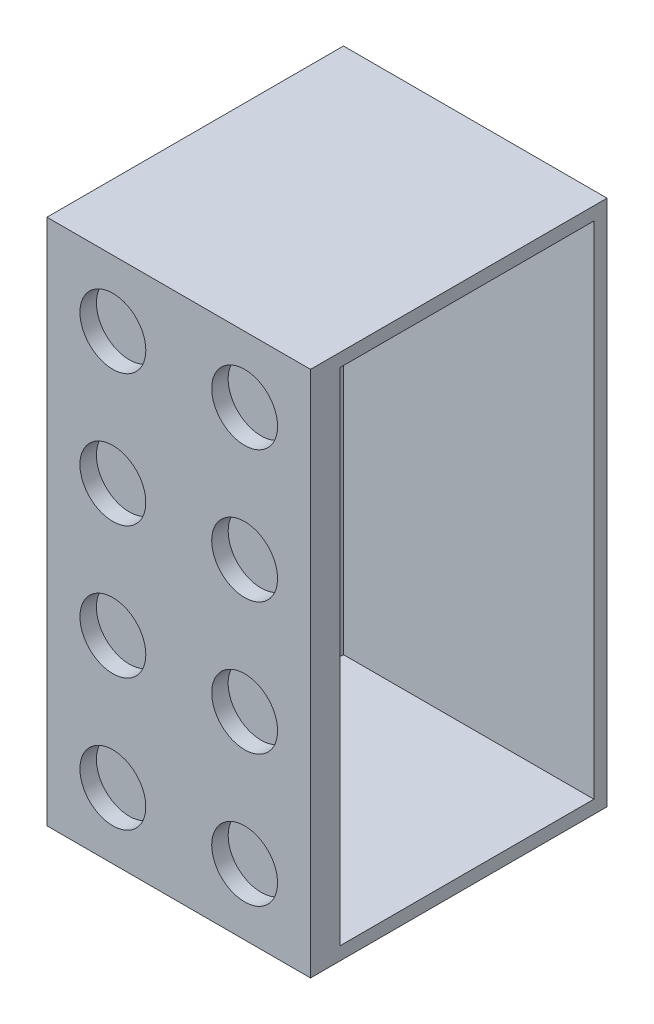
ISO-10303-21;
HEADER;
FILE_DESCRIPTION(('STEP AP214'),'2;1');
FILE_NAME('part.step','',(''),(''),'','','');
FILE_SCHEMA(('AUTOMOTIVE_DESIGN { 1 0 10303 214 1 1 1 1 }'));
ENDSEC;
DATA;
#1=APPLICATION_CONTEXT('core data for automotive mechanical design processes');
#2=APPLICATION_PROTOCOL_DEFINITION('international standard','automotive_design',2000,#1);
#3=PRODUCT_CONTEXT('',#1,'mechanical');
#4=PRODUCT('Part','Part','',(#3));
#5=PRODUCT_RELATED_PRODUCT_CATEGORY('part','',(#4));
#6=PRODUCT_DEFINITION_FORMATION('','',#4);
#7=PRODUCT_DEFINITION_CONTEXT('part definition',#1,'design');
#8=PRODUCT_DEFINITION('design','',#6,#7);
#9=PRODUCT_DEFINITION_SHAPE('','',#8);
#10=(LENGTH_UNIT() NAMED_UNIT(*) SI_UNIT(.MILLI.,.METRE.));
#11=(NAMED_UNIT(*) PLANE_ANGLE_UNIT() SI_UNIT($,.RADIAN.));
#12=(NAMED_UNIT(*) SI_UNIT($,.STERADIAN.) SOLID_ANGLE_UNIT());
#13=UNCERTAINTY_MEASURE_WITH_UNIT(LENGTH_MEASURE(1.E-05),#10,'distance_accuracy_value','');
#14=(GEOMETRIC_REPRESENTATION_CONTEXT(3) GLOBAL_UNCERTAINTY_ASSIGNED_CONTEXT((#13)) GLOBAL_UNIT_ASSIGNED_CONTEXT((#10,
#11,#12)) REPRESENTATION_CONTEXT('',''));
#15=CARTESIAN_POINT('',(0.,0.,0.));
#16=DIRECTION('',(0.,0.,1.));
#17=DIRECTION('',(1.,0.,0.));
#18=AXIS2_PLACEMENT_3D('',#15,#16,#17);
#19=CARTESIAN_POINT('',(0.,0.,57.15));
#20=DIRECTION('',(0.,0.,-1.));
#21=DIRECTION('',(-1.,0.,0.));
#22=AXIS2_PLACEMENT_3D('',#19,#20,#21);
#23=PLANE('',#22);
#24=CARTESIAN_POINT('',(12.7,63.5,57.15));
#25=DIRECTION('',(0.,0.,-1.));
#26=DIRECTION('',(-1.,0.,0.));
#27=AXIS2_PLACEMENT_3D('',#24,#25,#26);
#28=CIRCLE('',#27,6.35);
#29=CARTESIAN_POINT('',(6.35,63.5,57.15));
#30=VERTEX_POINT('',#29);
#31=EDGE_CURVE('E211',#30,#30,#28,.T.);
#32=ORIENTED_EDGE('',*,*,#31,.T.);
#33=EDGE_LOOP('',(#32));
#34=FACE_BOUND('',#33,.T.);
#35=CARTESIAN_POINT('',(12.7,38.1,57.15));
#36=DIRECTION('',(0.,0.,1.));
#37=DIRECTION('',(1.,0.,0.));
#38=AXIS2_PLACEMENT_3D('',#35,#36,#37);
#39=CIRCLE('',#38,6.35);
#40=CARTESIAN_POINT('',(19.05,38.1,57.15));
#41=VERTEX_POINT('',#40);
#42=EDGE_CURVE('E195',#41,#41,#39,.T.);
#43=ORIENTED_EDGE('',*,*,#42,.F.);
#44=EDGE_LOOP('',(#43));
#45=FACE_BOUND('',#44,.T.);
#46=CARTESIAN_POINT('',(38.1,63.5,57.15));
#47=DIRECTION('',(0.,0.,-1.));
#48=DIRECTION('',(-1.,0.,0.));
#49=AXIS2_PLACEMENT_3D('',#46,#47,#48);
#50=CIRCLE('',#49,6.35);
#51=CARTESIAN_POINT('',(31.75,63.5,57.15));
#52=VERTEX_POINT('',#51);
#53=EDGE_CURVE('E203',#52,#52,#50,.T.);
#54=ORIENTED_EDGE('',*,*,#53,.T.);
#55=EDGE_LOOP('',(#54));
#56=FACE_BOUND('',#55,.T.);
#57=CARTESIAN_POINT('',(38.1,38.1,57.15));
#58=DIRECTION('',(0.,0.,1.));
#59=DIRECTION('',(1.,0.,0.));
#60=AXIS2_PLACEMENT_3D('',#57,#58,#59);
#61=CIRCLE('',#60,6.35);
#62=CARTESIAN_POINT('',(44.45,38.1,57.15));
#63=VERTEX_POINT('',#62);
#64=EDGE_CURVE('E187',#63,#63,#61,.T.);
#65=ORIENTED_EDGE('',*,*,#64,.F.);
#66=EDGE_LOOP('',(#65));
#67=FACE_BOUND('',#66,.T.);
#68=CARTESIAN_POINT('',(12.7,12.7,57.15));
#69=DIRECTION('',(0.,0.,-1.));
#70=DIRECTION('',(-1.,0.,0.));
#71=AXIS2_PLACEMENT_3D('',#68,#69,#70);
#72=CIRCLE('',#71,6.35);
#73=CARTESIAN_POINT('',(6.35,12.7,57.15));
#74=VERTEX_POINT('',#73);
#75=EDGE_CURVE('E179',#74,#74,#72,.T.);
#76=ORIENTED_EDGE('',*,*,#75,.T.);
#77=EDGE_LOOP('',(#76));
#78=FACE_BOUND('',#77,.T.);
#79=DIRECTION('',(0.,-1.,0.));
#80=VECTOR('',#79,1.);
#81=CARTESIAN_POINT('',(0.,0.,57.15));
#82=LINE('',#81,#80);
#83=CARTESIAN_POINT('',(0.,101.6,57.15));
#84=VERTEX_POINT('',#83);
#85=CARTESIAN_POINT('',(0.,0.,57.15));
#86=VERTEX_POINT('',#85);
#87=EDGE_CURVE('E235',#84,#86,#82,.T.);
#88=ORIENTED_EDGE('',*,*,#87,.T.);
#89=DIRECTION('',(1.,0.,0.));
#90=VECTOR('',#89,1.);
#91=CARTESIAN_POINT('',(0.,0.,57.15));
#92=LINE('',#91,#90);
#93=CARTESIAN_POINT('',(50.8,0.,57.15));
#94=VERTEX_POINT('',#93);
#95=EDGE_CURVE('E98',#86,#94,#92,.T.);
#96=ORIENTED_EDGE('',*,*,#95,.T.);
#97=DIRECTION('',(0.,1.,0.));
#98=VECTOR('',#97,1.);
#99=CARTESIAN_POINT('',(50.8,0.,57.15));
#100=LINE('',#99,#98);
#101=CARTESIAN_POINT('',(50.8,101.6,57.15));
#102=VERTEX_POINT('',#101);
#103=EDGE_CURVE('E240',#94,#102,#100,.T.);
#104=ORIENTED_EDGE('',*,*,#103,.T.);
#105=DIRECTION('',(-1.,0.,0.));
#106=VECTOR('',#105,1.);
#107=CARTESIAN_POINT('',(0.,101.6,57.15));
#108=LINE('',#107,#106);
#109=EDGE_CURVE('E70',#102,#84,#108,.T.);
#110=ORIENTED_EDGE('',*,*,#109,.T.);
#111=EDGE_LOOP('',(#88,#96,#104,#110));
#112=FACE_BOUND('',#111,.T.);
#113=CARTESIAN_POINT('',(38.1,12.7,57.15));
#114=DIRECTION('',(0.,0.,-1.));
#115=DIRECTION('',(-1.,0.,0.));
#116=AXIS2_PLACEMENT_3D('',#113,#114,#115);
#117=CIRCLE('',#116,6.35);
#118=CARTESIAN_POINT('',(31.75,12.7,57.15));
#119=VERTEX_POINT('',#118);
#120=EDGE_CURVE('E171',#119,#119,#117,.T.);
#121=ORIENTED_EDGE('',*,*,#120,.T.);
#122=EDGE_LOOP('',(#121));
#123=FACE_BOUND('',#122,.T.);
#124=CARTESIAN_POINT('',(12.7,88.9,57.15));
#125=DIRECTION('',(0.,0.,1.));
#126=DIRECTION('',(1.,0.,0.));
#127=AXIS2_PLACEMENT_3D('',#124,#125,#126);
#128=CIRCLE('',#127,6.35);
#129=CARTESIAN_POINT('',(19.05,88.9,57.15));
#130=VERTEX_POINT('',#129);
#131=EDGE_CURVE('E227',#130,#130,#128,.T.);
#132=ORIENTED_EDGE('',*,*,#131,.F.);
#133=EDGE_LOOP('',(#132));
#134=FACE_BOUND('',#133,.T.);
#135=CARTESIAN_POINT('',(38.1,88.9,57.15));
#136=DIRECTION('',(0.,0.,1.));
#137=DIRECTION('',(1.,0.,0.));
#138=AXIS2_PLACEMENT_3D('',#135,#136,#137);
#139=CIRCLE('',#138,6.35);
#140=CARTESIAN_POINT('',(44.45,88.9,57.15));
#141=VERTEX_POINT('',#140);
#142=EDGE_CURVE('E219',#141,#141,#139,.T.);
#143=ORIENTED_EDGE('',*,*,#142,.F.);
#144=EDGE_LOOP('',(#143));
#145=FACE_BOUND('',#144,.T.);
#146=ADVANCED_FACE('F45',(#34,#45,#56,#67,#78,#112,#123,#134,#145),#23,.F.);
#147=CARTESIAN_POINT('',(0.,0.,57.15));
#148=DIRECTION('',(1.,0.,0.));
#149=DIRECTION('',(0.,0.,-1.));
#150=AXIS2_PLACEMENT_3D('',#147,#148,#149);
#151=PLANE('',#150);
#152=DIRECTION('',(0.,-1.,0.));
#153=VECTOR('',#152,1.);
#154=CARTESIAN_POINT('',(0.,0.,0.));
#155=LINE('',#154,#153);
#156=CARTESIAN_POINT('',(0.,101.6,0.));
#157=VERTEX_POINT('',#156);
#158=CARTESIAN_POINT('',(0.,0.,0.));
#159=VERTEX_POINT('',#158);
#160=EDGE_CURVE('E231',#157,#159,#155,.T.);
#161=ORIENTED_EDGE('',*,*,#160,.T.);
#162=DIRECTION('',(0.,0.,-1.));
#163=VECTOR('',#162,1.);
#164=CARTESIAN_POINT('',(0.,0.,57.15));
#165=LINE('',#164,#163);
#166=EDGE_CURVE('E11',#86,#159,#165,.T.);
#167=ORIENTED_EDGE('',*,*,#166,.F.);
#168=ORIENTED_EDGE('',*,*,#87,.F.);
#169=DIRECTION('',(0.,0.,-1.));
#170=VECTOR('',#169,1.);
#171=CARTESIAN_POINT('',(0.,101.6,57.15));
#172=LINE('',#171,#170);
#173=EDGE_CURVE('E245',#84,#157,#172,.T.);
#174=ORIENTED_EDGE('',*,*,#173,.T.);
#175=EDGE_LOOP('',(#161,#167,#168,#174));
#176=FACE_BOUND('',#175,.T.);
#177=ADVANCED_FACE('F47',(#176),#151,.F.);
#178=CARTESIAN_POINT('',(0.,0.,57.15));
#179=DIRECTION('',(0.,1.,0.));
#180=DIRECTION('',(0.,0.,1.));
#181=AXIS2_PLACEMENT_3D('',#178,#179,#180);
#182=PLANE('',#181);
#183=DIRECTION('',(1.,0.,0.));
#184=VECTOR('',#183,1.);
#185=CARTESIAN_POINT('',(0.,0.,0.));
#186=LINE('',#185,#184);
#187=CARTESIAN_POINT('',(50.8,0.,0.));
#188=VERTEX_POINT('',#187);
#189=EDGE_CURVE('E249',#159,#188,#186,.T.);
#190=ORIENTED_EDGE('',*,*,#189,.T.);
#191=DIRECTION('',(0.,0.,-1.));
#192=VECTOR('',#191,1.);
#193=CARTESIAN_POINT('',(50.8,0.,57.15));
#194=LINE('',#193,#192);
#195=EDGE_CURVE('E54',#94,#188,#194,.T.);
#196=ORIENTED_EDGE('',*,*,#195,.F.);
#197=ORIENTED_EDGE('',*,*,#95,.F.);
#198=ORIENTED_EDGE('',*,*,#166,.T.);
#199=EDGE_LOOP('',(#190,#196,#197,#198));
#200=FACE_BOUND('',#199,.T.);
#201=ADVANCED_FACE('F284',(#200),#182,.F.);
#202=CARTESIAN_POINT('',(50.8,0.,57.15));
#203=DIRECTION('',(-1.,0.,0.));
#204=DIRECTION('',(0.,0.,1.));
#205=AXIS2_PLACEMENT_3D('',#202,#203,#204);
#206=PLANE('',#205);
#207=DIRECTION('',(0.,-1.,0.));
#208=VECTOR('',#207,1.);
#209=CARTESIAN_POINT('',(50.8,99.06,51.435));
#210=LINE('',#209,#208);
#211=CARTESIAN_POINT('',(50.8,99.06,51.435));
#212=VERTEX_POINT('',#211);
#213=CARTESIAN_POINT('',(50.8,2.54,51.435));
#214=VERTEX_POINT('',#213);
#215=EDGE_CURVE('E156',#212,#214,#210,.T.);
#216=ORIENTED_EDGE('',*,*,#215,.F.);
#217=DIRECTION('',(0.,0.,1.));
#218=VECTOR('',#217,1.);
#219=CARTESIAN_POINT('',(50.8,99.06,2.54));
#220=LINE('',#219,#218);
#221=CARTESIAN_POINT('',(50.8,99.06,2.54));
#222=VERTEX_POINT('',#221);
#223=EDGE_CURVE('E61',#222,#212,#220,.T.);
#224=ORIENTED_EDGE('',*,*,#223,.F.);
#225=DIRECTION('',(0.,1.,0.));
#226=VECTOR('',#225,1.);
#227=CARTESIAN_POINT('',(50.8,2.54,2.54));
#228=LINE('',#227,#226);
#229=CARTESIAN_POINT('',(50.8,2.54,2.54));
#230=VERTEX_POINT('',#229);
#231=EDGE_CURVE('E143',#230,#222,#228,.T.);
#232=ORIENTED_EDGE('',*,*,#231,.F.);
#233=DIRECTION('',(0.,0.,-1.));
#234=VECTOR('',#233,1.);
#235=CARTESIAN_POINT('',(50.8,2.54,51.435));
#236=LINE('',#235,#234);
#237=EDGE_CURVE('E147',#214,#230,#236,.T.);
#238=ORIENTED_EDGE('',*,*,#237,.F.);
#239=EDGE_LOOP('',(#216,#224,#232,#238));
#240=FACE_BOUND('',#239,.T.);
#241=DIRECTION('',(0.,1.,0.));
#242=VECTOR('',#241,1.);
#243=CARTESIAN_POINT('',(50.8,0.,0.));
#244=LINE('',#243,#242);
#245=CARTESIAN_POINT('',(50.8,101.6,0.));
#246=VERTEX_POINT('',#245);
#247=EDGE_CURVE('E252',#188,#246,#244,.T.);
#248=ORIENTED_EDGE('',*,*,#247,.T.);
#249=DIRECTION('',(0.,0.,-1.));
#250=VECTOR('',#249,1.);
#251=CARTESIAN_POINT('',(50.8,101.6,57.15));
#252=LINE('',#251,#250);
#253=EDGE_CURVE('E259',#102,#246,#252,.T.);
#254=ORIENTED_EDGE('',*,*,#253,.F.);
#255=ORIENTED_EDGE('',*,*,#103,.F.);
#256=ORIENTED_EDGE('',*,*,#195,.T.);
#257=EDGE_LOOP('',(#248,#254,#255,#256));
#258=FACE_BOUND('',#257,.T.);
#259=ADVANCED_FACE('F266',(#240,#258),#206,.F.);
#260=CARTESIAN_POINT('',(0.,101.6,57.15));
#261=DIRECTION('',(0.,-1.,0.));
#262=DIRECTION('',(0.,0.,-1.));
#263=AXIS2_PLACEMENT_3D('',#260,#261,#262);
#264=PLANE('',#263);
#265=DIRECTION('',(-1.,0.,0.));
#266=VECTOR('',#265,1.);
#267=CARTESIAN_POINT('',(0.,101.6,0.));
#268=LINE('',#267,#266);
#269=EDGE_CURVE('E91',#246,#157,#268,.T.);
#270=ORIENTED_EDGE('',*,*,#269,.T.);
#271=ORIENTED_EDGE('',*,*,#173,.F.);
#272=ORIENTED_EDGE('',*,*,#109,.F.);
#273=ORIENTED_EDGE('',*,*,#253,.T.);
#274=EDGE_LOOP('',(#270,#271,#272,#273));
#275=FACE_BOUND('',#274,.T.);
#276=ADVANCED_FACE('F274',(#275),#264,.F.);
#277=CARTESIAN_POINT('',(0.,0.,0.));
#278=DIRECTION('',(0.,0.,-1.));
#279=DIRECTION('',(-1.,0.,0.));
#280=AXIS2_PLACEMENT_3D('',#277,#278,#279);
#281=PLANE('',#280);
#282=ORIENTED_EDGE('',*,*,#160,.F.);
#283=ORIENTED_EDGE('',*,*,#269,.F.);
#284=ORIENTED_EDGE('',*,*,#247,.F.);
#285=ORIENTED_EDGE('',*,*,#189,.F.);
#286=EDGE_LOOP('',(#282,#283,#284,#285));
#287=FACE_BOUND('',#286,.T.);
#288=ADVANCED_FACE('F270',(#287),#281,.T.);
#289=CARTESIAN_POINT('',(12.7,12.7,53.975));
#290=DIRECTION('',(0.,0.,1.));
#291=DIRECTION('',(1.,0.,0.));
#292=AXIS2_PLACEMENT_3D('',#289,#290,#291);
#293=CYLINDRICAL_SURFACE('',#292,6.35);
#294=CARTESIAN_POINT('',(12.7,12.7,53.975));
#295=DIRECTION('',(0.,0.,-1.));
#296=DIRECTION('',(-1.,0.,0.));
#297=AXIS2_PLACEMENT_3D('',#294,#295,#296);
#298=CIRCLE('',#297,6.35);
#299=CARTESIAN_POINT('',(6.35,12.7,53.975));
#300=VERTEX_POINT('',#299);
#301=EDGE_CURVE('E175',#300,#300,#298,.T.);
#302=ORIENTED_EDGE('',*,*,#301,.T.);
#303=EDGE_LOOP('',(#302));
#304=FACE_BOUND('',#303,.T.);
#305=ORIENTED_EDGE('',*,*,#75,.F.);
#306=EDGE_LOOP('',(#305));
#307=FACE_BOUND('',#306,.T.);
#308=ADVANCED_FACE('F281',(#304,#307),#293,.F.);
#309=CARTESIAN_POINT('',(12.7,12.7,53.975));
#310=DIRECTION('',(0.,0.,-1.));
#311=DIRECTION('',(-1.,0.,0.));
#312=AXIS2_PLACEMENT_3D('',#309,#310,#311);
#313=PLANE('',#312);
#314=ORIENTED_EDGE('',*,*,#301,.F.);
#315=EDGE_LOOP('',(#314));
#316=FACE_BOUND('',#315,.T.);
#317=ADVANCED_FACE('F345',(#316),#313,.F.);
#318=CARTESIAN_POINT('',(38.1,38.1,53.975));
#319=DIRECTION('',(0.,0.,1.));
#320=DIRECTION('',(1.,0.,0.));
#321=AXIS2_PLACEMENT_3D('',#318,#319,#320);
#322=CYLINDRICAL_SURFACE('',#321,6.35);
#323=CARTESIAN_POINT('',(38.1,38.1,53.975));
#324=DIRECTION('',(0.,0.,1.));
#325=DIRECTION('',(1.,0.,0.));
#326=AXIS2_PLACEMENT_3D('',#323,#324,#325);
#327=CIRCLE('',#326,6.35);
#328=CARTESIAN_POINT('',(44.45,38.1,53.975));
#329=VERTEX_POINT('',#328);
#330=EDGE_CURVE('E183',#329,#329,#327,.T.);
#331=ORIENTED_EDGE('',*,*,#330,.F.);
#332=EDGE_LOOP('',(#331));
#333=FACE_BOUND('',#332,.T.);
#334=ORIENTED_EDGE('',*,*,#64,.T.);
#335=EDGE_LOOP('',(#334));
#336=FACE_BOUND('',#335,.T.);
#337=ADVANCED_FACE('F341',(#333,#336),#322,.F.);
#338=CARTESIAN_POINT('',(38.1,38.1,53.975));
#339=DIRECTION('',(0.,0.,1.));
#340=DIRECTION('',(1.,0.,0.));
#341=AXIS2_PLACEMENT_3D('',#338,#339,#340);
#342=PLANE('',#341);
#343=ORIENTED_EDGE('',*,*,#330,.T.);
#344=EDGE_LOOP('',(#343));
#345=FACE_BOUND('',#344,.T.);
#346=ADVANCED_FACE('F337',(#345),#342,.T.);
#347=CARTESIAN_POINT('',(38.1,12.7,53.975));
#348=DIRECTION('',(0.,0.,1.));
#349=DIRECTION('',(1.,0.,0.));
#350=AXIS2_PLACEMENT_3D('',#347,#348,#349);
#351=CYLINDRICAL_SURFACE('',#350,6.35);
#352=CARTESIAN_POINT('',(38.1,12.7,53.975));
#353=DIRECTION('',(0.,0.,-1.));
#354=DIRECTION('',(-1.,0.,0.));
#355=AXIS2_PLACEMENT_3D('',#352,#353,#354);
#356=CIRCLE('',#355,6.35);
#357=CARTESIAN_POINT('',(31.75,12.7,53.975));
#358=VERTEX_POINT('',#357);
#359=EDGE_CURVE('E165',#358,#358,#356,.T.);
#360=ORIENTED_EDGE('',*,*,#359,.T.);
#361=EDGE_LOOP('',(#360));
#362=FACE_BOUND('',#361,.T.);
#363=ORIENTED_EDGE('',*,*,#120,.F.);
#364=EDGE_LOOP('',(#363));
#365=FACE_BOUND('',#364,.T.);
#366=ADVANCED_FACE('F340',(#362,#365),#351,.F.);
#367=CARTESIAN_POINT('',(38.1,12.7,53.975));
#368=DIRECTION('',(0.,0.,-1.));
#369=DIRECTION('',(-1.,0.,0.));
#370=AXIS2_PLACEMENT_3D('',#367,#368,#369);
#371=PLANE('',#370);
#372=ORIENTED_EDGE('',*,*,#359,.F.);
#373=EDGE_LOOP('',(#372));
#374=FACE_BOUND('',#373,.T.);
#375=ADVANCED_FACE('F304',(#374),#371,.F.);
#376=CARTESIAN_POINT('',(12.7,88.9,53.975));
#377=DIRECTION('',(0.,0.,1.));
#378=DIRECTION('',(1.,0.,0.));
#379=AXIS2_PLACEMENT_3D('',#376,#377,#378);
#380=CYLINDRICAL_SURFACE('',#379,6.35);
#381=CARTESIAN_POINT('',(12.7,88.9,53.975));
#382=DIRECTION('',(0.,0.,1.));
#383=DIRECTION('',(1.,0.,0.));
#384=AXIS2_PLACEMENT_3D('',#381,#382,#383);
#385=CIRCLE('',#384,6.35);
#386=CARTESIAN_POINT('',(19.05,88.9,53.975));
#387=VERTEX_POINT('',#386);
#388=EDGE_CURVE('E223',#387,#387,#385,.T.);
#389=ORIENTED_EDGE('',*,*,#388,.F.);
#390=EDGE_LOOP('',(#389));
#391=FACE_BOUND('',#390,.T.);
#392=ORIENTED_EDGE('',*,*,#131,.T.);
#393=EDGE_LOOP('',(#392));
#394=FACE_BOUND('',#393,.T.);
#395=ADVANCED_FACE('F300',(#391,#394),#380,.F.);
#396=CARTESIAN_POINT('',(12.7,88.9,53.975));
#397=DIRECTION('',(0.,0.,1.));
#398=DIRECTION('',(1.,0.,0.));
#399=AXIS2_PLACEMENT_3D('',#396,#397,#398);
#400=PLANE('',#399);
#401=ORIENTED_EDGE('',*,*,#388,.T.);
#402=EDGE_LOOP('',(#401));
#403=FACE_BOUND('',#402,.T.);
#404=ADVANCED_FACE('F296',(#403),#400,.T.);
#405=CARTESIAN_POINT('',(38.1,63.5,53.975));
#406=DIRECTION('',(0.,0.,1.));
#407=DIRECTION('',(1.,0.,0.));
#408=AXIS2_PLACEMENT_3D('',#405,#406,#407);
#409=CYLINDRICAL_SURFACE('',#408,6.35);
#410=CARTESIAN_POINT('',(38.1,63.5,53.975));
#411=DIRECTION('',(0.,0.,-1.));
#412=DIRECTION('',(-1.,0.,0.));
#413=AXIS2_PLACEMENT_3D('',#410,#411,#412);
#414=CIRCLE('',#413,6.35);
#415=CARTESIAN_POINT('',(31.75,63.5,53.975));
#416=VERTEX_POINT('',#415);
#417=EDGE_CURVE('E199',#416,#416,#414,.T.);
#418=ORIENTED_EDGE('',*,*,#417,.T.);
#419=EDGE_LOOP('',(#418));
#420=FACE_BOUND('',#419,.T.);
#421=ORIENTED_EDGE('',*,*,#53,.F.);
#422=EDGE_LOOP('',(#421));
#423=FACE_BOUND('',#422,.T.);
#424=ADVANCED_FACE('F299',(#420,#423),#409,.F.);
#425=CARTESIAN_POINT('',(38.1,63.5,53.975));
#426=DIRECTION('',(0.,0.,-1.));
#427=DIRECTION('',(-1.,0.,0.));
#428=AXIS2_PLACEMENT_3D('',#425,#426,#427);
#429=PLANE('',#428);
#430=ORIENTED_EDGE('',*,*,#417,.F.);
#431=EDGE_LOOP('',(#430));
#432=FACE_BOUND('',#431,.T.);
#433=ADVANCED_FACE('F323',(#432),#429,.F.);
#434=CARTESIAN_POINT('',(12.7,38.1,53.975));
#435=DIRECTION('',(0.,0.,1.));
#436=DIRECTION('',(1.,0.,0.));
#437=AXIS2_PLACEMENT_3D('',#434,#435,#436);
#438=CYLINDRICAL_SURFACE('',#437,6.35);
#439=CARTESIAN_POINT('',(12.7,38.1,53.975));
#440=DIRECTION('',(0.,0.,1.));
#441=DIRECTION('',(1.,0.,0.));
#442=AXIS2_PLACEMENT_3D('',#439,#440,#441);
#443=CIRCLE('',#442,6.35);
#444=CARTESIAN_POINT('',(19.05,38.1,53.975));
#445=VERTEX_POINT('',#444);
#446=EDGE_CURVE('E191',#445,#445,#443,.T.);
#447=ORIENTED_EDGE('',*,*,#446,.F.);
#448=EDGE_LOOP('',(#447));
#449=FACE_BOUND('',#448,.T.);
#450=ORIENTED_EDGE('',*,*,#42,.T.);
#451=EDGE_LOOP('',(#450));
#452=FACE_BOUND('',#451,.T.);
#453=ADVANCED_FACE('F326',(#449,#452),#438,.F.);
#454=CARTESIAN_POINT('',(12.7,38.1,53.975));
#455=DIRECTION('',(0.,0.,1.));
#456=DIRECTION('',(1.,0.,0.));
#457=AXIS2_PLACEMENT_3D('',#454,#455,#456);
#458=PLANE('',#457);
#459=ORIENTED_EDGE('',*,*,#446,.T.);
#460=EDGE_LOOP('',(#459));
#461=FACE_BOUND('',#460,.T.);
#462=ADVANCED_FACE('F314',(#461),#458,.T.);
#463=CARTESIAN_POINT('',(38.1,88.9,53.975));
#464=DIRECTION('',(0.,0.,1.));
#465=DIRECTION('',(1.,0.,0.));
#466=AXIS2_PLACEMENT_3D('',#463,#464,#465);
#467=CYLINDRICAL_SURFACE('',#466,6.35);
#468=CARTESIAN_POINT('',(38.1,88.9,53.975));
#469=DIRECTION('',(0.,0.,1.));
#470=DIRECTION('',(1.,0.,0.));
#471=AXIS2_PLACEMENT_3D('',#468,#469,#470);
#472=CIRCLE('',#471,6.35);
#473=CARTESIAN_POINT('',(44.45,88.9,53.975));
#474=VERTEX_POINT('',#473);
#475=EDGE_CURVE('E215',#474,#474,#472,.T.);
#476=ORIENTED_EDGE('',*,*,#475,.F.);
#477=EDGE_LOOP('',(#476));
#478=FACE_BOUND('',#477,.T.);
#479=ORIENTED_EDGE('',*,*,#142,.T.);
#480=EDGE_LOOP('',(#479));
#481=FACE_BOUND('',#480,.T.);
#482=ADVANCED_FACE('F310',(#478,#481),#467,.F.);
#483=CARTESIAN_POINT('',(38.1,88.9,53.975));
#484=DIRECTION('',(0.,0.,1.));
#485=DIRECTION('',(1.,0.,0.));
#486=AXIS2_PLACEMENT_3D('',#483,#484,#485);
#487=PLANE('',#486);
#488=ORIENTED_EDGE('',*,*,#475,.T.);
#489=EDGE_LOOP('',(#488));
#490=FACE_BOUND('',#489,.T.);
#491=ADVANCED_FACE('F306',(#490),#487,.T.);
#492=CARTESIAN_POINT('',(12.7,63.5,53.975));
#493=DIRECTION('',(0.,0.,1.));
#494=DIRECTION('',(1.,0.,0.));
#495=AXIS2_PLACEMENT_3D('',#492,#493,#494);
#496=CYLINDRICAL_SURFACE('',#495,6.35);
#497=CARTESIAN_POINT('',(12.7,63.5,53.975));
#498=DIRECTION('',(0.,0.,-1.));
#499=DIRECTION('',(-1.,0.,0.));
#500=AXIS2_PLACEMENT_3D('',#497,#498,#499);
#501=CIRCLE('',#500,6.35);
#502=CARTESIAN_POINT('',(6.35,63.5,53.975));
#503=VERTEX_POINT('',#502);
#504=EDGE_CURVE('E207',#503,#503,#501,.T.);
#505=ORIENTED_EDGE('',*,*,#504,.T.);
#506=EDGE_LOOP('',(#505));
#507=FACE_BOUND('',#506,.T.);
#508=ORIENTED_EDGE('',*,*,#31,.F.);
#509=EDGE_LOOP('',(#508));
#510=FACE_BOUND('',#509,.T.);
#511=ADVANCED_FACE('F309',(#507,#510),#496,.F.);
#512=CARTESIAN_POINT('',(12.7,63.5,53.975));
#513=DIRECTION('',(0.,0.,-1.));
#514=DIRECTION('',(-1.,0.,0.));
#515=AXIS2_PLACEMENT_3D('',#512,#513,#514);
#516=PLANE('',#515);
#517=ORIENTED_EDGE('',*,*,#504,.F.);
#518=EDGE_LOOP('',(#517));
#519=FACE_BOUND('',#518,.T.);
#520=ADVANCED_FACE('F316',(#519),#516,.F.);
#521=CARTESIAN_POINT('',(2.54,99.06,2.54));
#522=DIRECTION('',(0.,1.,0.));
#523=DIRECTION('',(0.,0.,1.));
#524=AXIS2_PLACEMENT_3D('',#521,#522,#523);
#525=PLANE('',#524);
#526=ORIENTED_EDGE('',*,*,#223,.T.);
#527=DIRECTION('',(1.,0.,0.));
#528=VECTOR('',#527,1.);
#529=CARTESIAN_POINT('',(2.54,99.06,51.435));
#530=LINE('',#529,#528);
#531=CARTESIAN_POINT('',(2.54,99.06,51.435));
#532=VERTEX_POINT('',#531);
#533=EDGE_CURVE('E118',#532,#212,#530,.T.);
#534=ORIENTED_EDGE('',*,*,#533,.F.);
#535=DIRECTION('',(0.,0.,1.));
#536=VECTOR('',#535,1.);
#537=CARTESIAN_POINT('',(2.54,99.06,2.54));
#538=LINE('',#537,#536);
#539=CARTESIAN_POINT('',(2.54,99.06,2.54));
#540=VERTEX_POINT('',#539);
#541=EDGE_CURVE('E122',#540,#532,#538,.T.);
#542=ORIENTED_EDGE('',*,*,#541,.F.);
#543=DIRECTION('',(1.,0.,0.));
#544=VECTOR('',#543,1.);
#545=CARTESIAN_POINT('',(2.54,99.06,2.54));
#546=LINE('',#545,#544);
#547=EDGE_CURVE('E162',#540,#222,#546,.T.);
#548=ORIENTED_EDGE('',*,*,#547,.T.);
#549=EDGE_LOOP('',(#526,#534,#542,#548));
#550=FACE_BOUND('',#549,.T.);
#551=ADVANCED_FACE('F120',(#550),#525,.F.);
#552=CARTESIAN_POINT('',(2.54,2.54,2.54));
#553=DIRECTION('',(0.,0.,-1.));
#554=DIRECTION('',(0.,1.,0.));
#555=AXIS2_PLACEMENT_3D('',#552,#553,#554);
#556=PLANE('',#555);
#557=ORIENTED_EDGE('',*,*,#231,.T.);
#558=ORIENTED_EDGE('',*,*,#547,.F.);
#559=DIRECTION('',(0.,1.,0.));
#560=VECTOR('',#559,1.);
#561=CARTESIAN_POINT('',(2.54,2.54,2.54));
#562=LINE('',#561,#560);
#563=CARTESIAN_POINT('',(2.54,2.54,2.54));
#564=VERTEX_POINT('',#563);
#565=EDGE_CURVE('E129',#564,#540,#562,.T.);
#566=ORIENTED_EDGE('',*,*,#565,.F.);
#567=DIRECTION('',(1.,0.,0.));
#568=VECTOR('',#567,1.);
#569=CARTESIAN_POINT('',(2.54,2.54,2.54));
#570=LINE('',#569,#568);
#571=EDGE_CURVE('E166',#564,#230,#570,.T.);
#572=ORIENTED_EDGE('',*,*,#571,.T.);
#573=EDGE_LOOP('',(#557,#558,#566,#572));
#574=FACE_BOUND('',#573,.T.);
#575=ADVANCED_FACE('F360',(#574),#556,.F.);
#576=CARTESIAN_POINT('',(2.54,2.54,51.435));
#577=DIRECTION('',(0.,-1.,0.));
#578=DIRECTION('',(0.,0.,-1.));
#579=AXIS2_PLACEMENT_3D('',#576,#577,#578);
#580=PLANE('',#579);
#581=ORIENTED_EDGE('',*,*,#237,.T.);
#582=ORIENTED_EDGE('',*,*,#571,.F.);
#583=DIRECTION('',(0.,0.,-1.));
#584=VECTOR('',#583,1.);
#585=CARTESIAN_POINT('',(2.54,2.54,51.435));
#586=LINE('',#585,#584);
#587=CARTESIAN_POINT('',(2.54,2.54,51.435));
#588=VERTEX_POINT('',#587);
#589=EDGE_CURVE('E138',#588,#564,#586,.T.);
#590=ORIENTED_EDGE('',*,*,#589,.F.);
#591=DIRECTION('',(1.,0.,0.));
#592=VECTOR('',#591,1.);
#593=CARTESIAN_POINT('',(2.54,2.54,51.435));
#594=LINE('',#593,#592);
#595=EDGE_CURVE('E128',#588,#214,#594,.T.);
#596=ORIENTED_EDGE('',*,*,#595,.T.);
#597=EDGE_LOOP('',(#581,#582,#590,#596));
#598=FACE_BOUND('',#597,.T.);
#599=ADVANCED_FACE('F363',(#598),#580,.F.);
#600=CARTESIAN_POINT('',(2.54,99.06,51.435));
#601=DIRECTION('',(0.,0.,1.));
#602=DIRECTION('',(0.,-1.,0.));
#603=AXIS2_PLACEMENT_3D('',#600,#601,#602);
#604=PLANE('',#603);
#605=ORIENTED_EDGE('',*,*,#215,.T.);
#606=ORIENTED_EDGE('',*,*,#595,.F.);
#607=DIRECTION('',(0.,-1.,0.));
#608=VECTOR('',#607,1.);
#609=CARTESIAN_POINT('',(2.54,99.06,51.435));
#610=LINE('',#609,#608);
#611=EDGE_CURVE('E132',#532,#588,#610,.T.);
#612=ORIENTED_EDGE('',*,*,#611,.F.);
#613=ORIENTED_EDGE('',*,*,#533,.T.);
#614=EDGE_LOOP('',(#605,#606,#612,#613));
#615=FACE_BOUND('',#614,.T.);
#616=ADVANCED_FACE('F133',(#615),#604,.F.);
#617=CARTESIAN_POINT('',(2.54,0.,0.));
#618=DIRECTION('',(1.,0.,0.));
#619=DIRECTION('',(0.,0.,-1.));
#620=AXIS2_PLACEMENT_3D('',#617,#618,#619);
#621=PLANE('',#620);
#622=ORIENTED_EDGE('',*,*,#541,.T.);
#623=ORIENTED_EDGE('',*,*,#611,.T.);
#624=ORIENTED_EDGE('',*,*,#589,.T.);
#625=ORIENTED_EDGE('',*,*,#565,.T.);
#626=EDGE_LOOP('',(#622,#623,#624,#625));
#627=FACE_BOUND('',#626,.T.);
#628=ADVANCED_FACE('F140',(#627),#621,.T.);
#629=CLOSED_SHELL('',(#146,#177,#201,#259,#276,#288,#308,#317,#337,#346,#366,#375,#395,#404,
#424,#433,#453,#462,#482,#491,#511,#520,#551,#575,#599,#616,#628));
#630=MANIFOLD_SOLID_BREP('B2',#629);
#631=ADVANCED_BREP_SHAPE_REPRESENTATION('',(#18,#630),#14);
#632=SHAPE_DEFINITION_REPRESENTATION(#9,#631);
ENDSEC;
END-ISO-10303-21;
